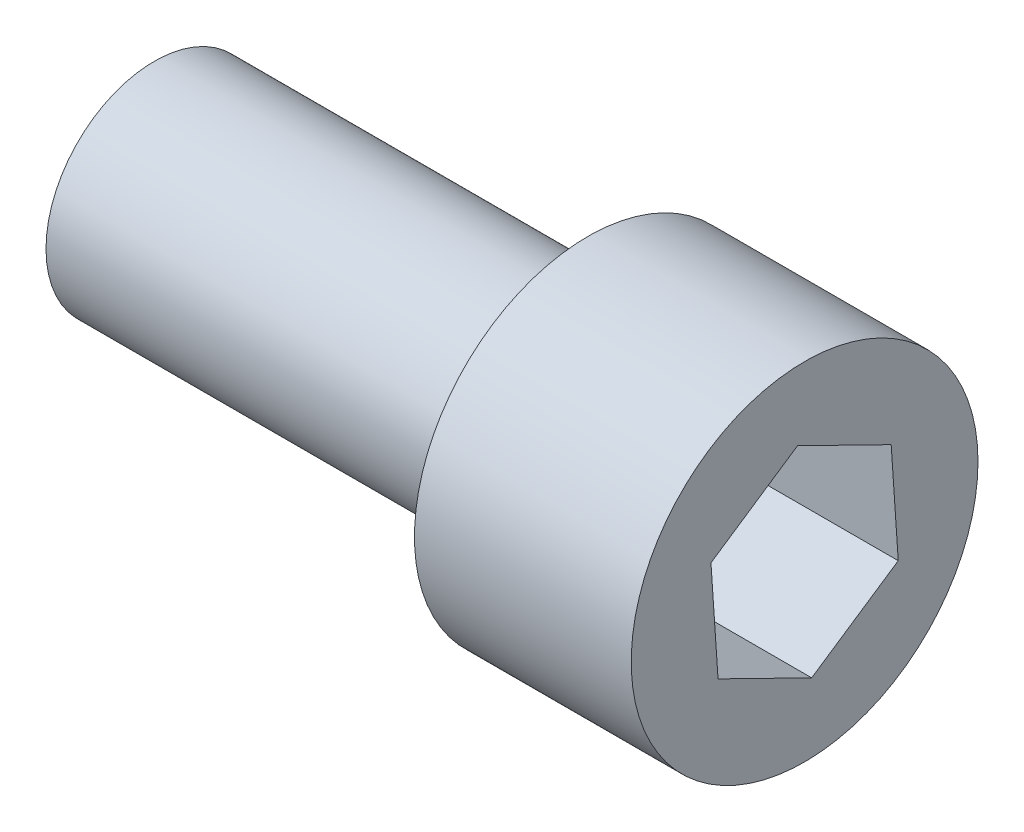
from build123d import *

# Parameters (mm, degrees)
ENL_V_MAT_EXTRU_1_DEPTH = 2


with BuildPart() as part:
    # Esquisse1 → R_volution1 (revolve)
    with BuildSketch(Plane.XY, mode=Mode.PRIVATE) as r_volution1_sk:
        Polygon((0, 0), (0, 2.4), (-3, 2.4), (-3, 1.5), (-9, 1.5), (-9, 0), align=None)
    revolve(r_volution1_sk.sketch.rotate(Axis((0, 0, 0), (-1, 0, 0)), 90), axis=Axis((0, 0, 0), (-1, 0, 0)))

    # Esquisse2 → Enl_v. mat.-Extru.1 (cut)
    with BuildSketch(Plane(origin=(0, 0, 0), x_dir=(0, 0, -1), z_dir=(1, 0, 0))):
        Polygon((1.296058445, -0.635268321), (1.198187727, 0.804785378), (-0.097870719, 1.440053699), (-1.296058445, 0.635268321), (-1.198187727, -0.804785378), (0.097870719, -1.440053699), align=None)
    extrude(amount=-ENL_V_MAT_EXTRU_1_DEPTH, mode=Mode.SUBTRACT)


solid = part.part
